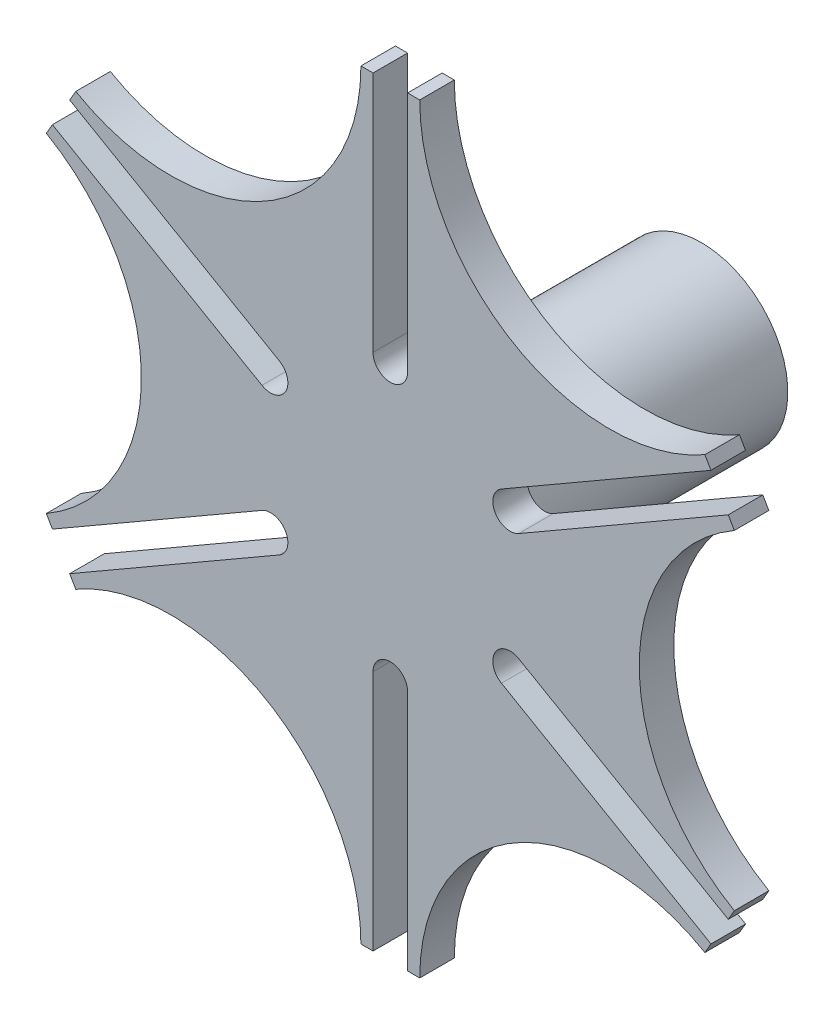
from build123d import *

# Parameters (mm, degrees)
BASE_EXTRUDE_DEPTH  = 12.7
SKETCH2_R           = 31.75
BOSS_EXTRUDE1_DEPTH = 101.6
CUT_EXTRUDE1_DEPTH  = 243.078568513
CIRPATTERN1_COUNT   = 6


with BuildPart() as part:
    # Sketch1 → Base-Extrude (new body)
    with BuildSketch(Plane.XY):
        Polygon((80.655832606, 139.7), (-80.655832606, 139.7), (-161.311665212, 0), (-80.655832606, -139.7), (80.655832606, -139.7), (161.311665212, 0), align=None)
    extrude(amount=BASE_EXTRUDE_DEPTH)

    # Sketch2 → Boss-Extrude1 (add)
    with BuildSketch(Plane(origin=(0, 0, 0), x_dir=(-1, 0, 0), z_dir=(0, 0, -1))):
        Circle(SKETCH2_R)
    extrude(amount=BOSS_EXTRUDE1_DEPTH)

    # Sketch3 → Cut-Extrude1 (cut, through all)
    with BuildSketch(Plane.XY.offset(12.7)):
        with BuildLine():
            Line((6.35, 139.7), (6.35, 50.8))
            ThreePointArc((6.35, 50.8), (0, 44.45), (-6.35, 50.8))
            Line((-6.35, 50.8), (-6.35, 139.7))
            Line((-6.35, 139.7), (6.35, 139.7))
        make_face()
        with BuildLine():
            Line((-80.655832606, 139.7), (-115.580832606, 79.208125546))
            ThreePointArc((-115.580832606, 79.208125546), (-45.730832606, 79.208125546), (-10.805832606, 139.7))
            Line((-10.805832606, 139.7), (-80.655832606, 139.7))
        make_face()
    cut_extrude1 = extrude(amount=-CUT_EXTRUDE1_DEPTH, mode=Mode.SUBTRACT)

    # CirPattern1: Cut-Extrude1 ×6 about axis
    cirpattern1_axis = Axis((0, 0, 0), (0, 0, 1))
    for i in range(1, CIRPATTERN1_COUNT):
        add(cut_extrude1.rotate(cirpattern1_axis, i * 360 / CIRPATTERN1_COUNT), mode=Mode.SUBTRACT)


solid = part.part
